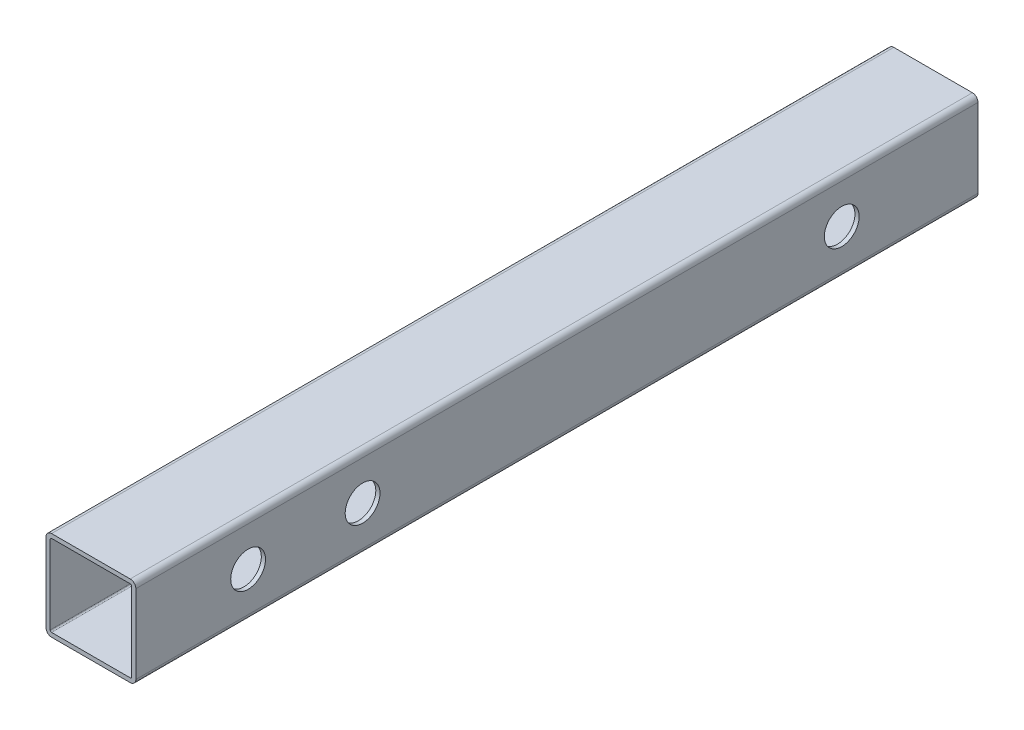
from build123d import *

# Parameters (mm, degrees)
EXTRUDE1_DEPTH     = 476.25
SKETCH2_R          = 19.685
CUT_EXTRUDE1_DEPTH = 490.609295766


with BuildPart() as part:
    # Sketch1 → Extrude1 (new, symmetric)
    with BuildSketch(Plane.XY):
        with BuildLine():
            Line((-44.45, 50.8), (44.45, 50.8))
            ThreePointArc((44.45, 50.8), (48.940128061, 48.940128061), (50.8, 44.45))
            Line((50.8, 44.45), (50.8, -44.45))
            ThreePointArc((50.8, -44.45), (48.940128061, -48.940128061), (44.45, -50.8))
            Line((44.45, -50.8), (-44.45, -50.8))
            ThreePointArc((-44.45, -50.8), (-48.940128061, -48.940128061), (-50.8, -44.45))
            Line((-50.8, -44.45), (-50.8, 44.45))
            ThreePointArc((-50.8, 44.45), (-48.940128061, 48.940128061), (-44.45, 50.8))
        make_face()
        with BuildLine():
            Line((-44.45, 46.0375), (44.45, 46.0375))
            ThreePointArc((44.45, 46.0375), (45.572532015, 45.572532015), (46.0375, 44.45))
            Line((46.0375, 44.45), (46.0375, -44.45))
            ThreePointArc((46.0375, -44.45), (45.572532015, -45.572532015), (44.45, -46.0375))
            Line((44.45, -46.0375), (-44.45, -46.0375))
            ThreePointArc((-44.45, -46.0375), (-45.572532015, -45.572532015), (-46.0375, -44.45))
            Line((-46.0375, -44.45), (-46.0375, 44.45))
            ThreePointArc((-46.0375, 44.45), (-45.572532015, 45.572532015), (-44.45, 46.0375))
        make_face(mode=Mode.SUBTRACT)
    extrude(amount=EXTRUDE1_DEPTH, both=True)

    # Sketch2 → Cut-Extrude1 (cut, through all)
    with BuildSketch(Plane.ZY.offset(50.8)):
        with Locations(Location((-322.13804, 0, 0), (0, 0, 270))):
            Circle(SKETCH2_R)
        with Locations(Location((219.77604, 0, 0), (0, 0, 270))):
            Circle(SKETCH2_R)
        with Locations(Location((349.25, 0, 0), (0, 0, 270))):
            Circle(SKETCH2_R)
    extrude(amount=-CUT_EXTRUDE1_DEPTH, mode=Mode.SUBTRACT)


solid = part.part
